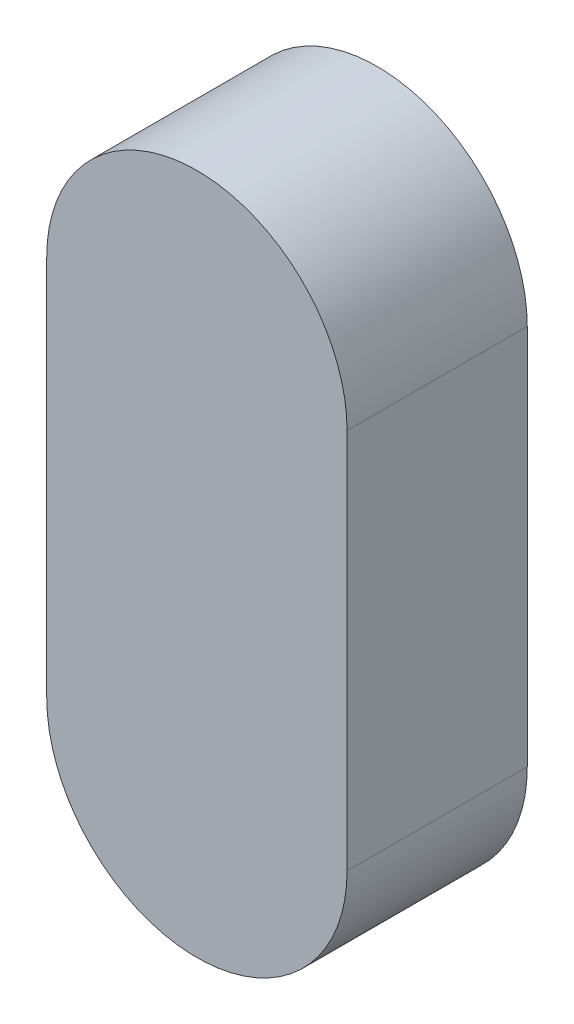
from build123d import *

# Parameters (mm, degrees)
BOSS_EXTRUDE1_DEPTH = 12


with BuildPart() as part:
    # Sketch1 → Boss-Extrude1 (new body)
    with BuildSketch(Plane.XY):
        with BuildLine():
            Line((-10, 0), (-10, 25.4))
            ThreePointArc((-10, 25.4), (0, 35.4), (10, 25.4))
            Line((10, 25.4), (10, 0))
            ThreePointArc((10, 0), (0, -10), (-10, 0))
        make_face()
    extrude(amount=BOSS_EXTRUDE1_DEPTH)


solid = part.part
